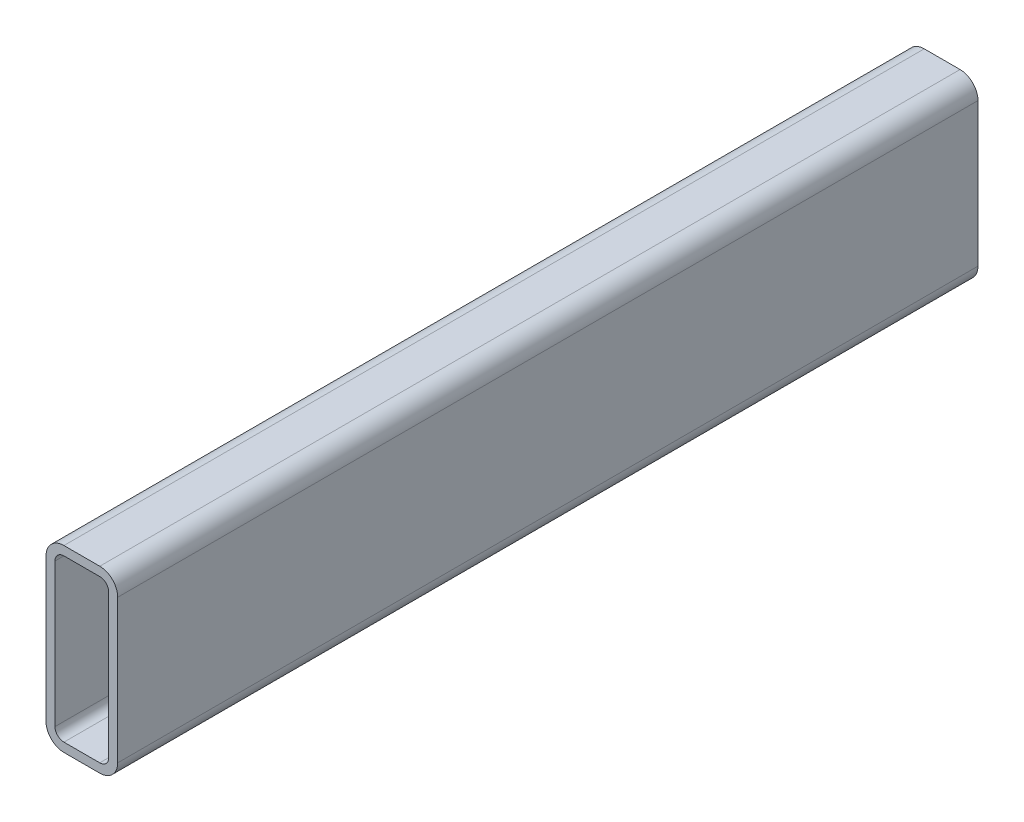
from build123d import *

# Parameters (mm, degrees)
BOSS_EXTRUDE1_DEPTH = 304.8


with BuildPart() as part:
    # Sketch1 → Boss-Extrude1 (new body)
    with BuildSketch(Plane.XY):
        with BuildLine():
            Line((25.4, 57.15), (25.4, 6.35))
            ThreePointArc((25.4, 6.35), (23.540128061, 1.859871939), (19.05, 0))
            Line((19.05, 0), (6.35, 0))
            ThreePointArc((6.35, 0), (1.859871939, 1.859871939), (0, 6.35))
            Line((0, 6.35), (0, 57.15))
            ThreePointArc((0, 57.15), (1.859871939, 61.640128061), (6.35, 63.5))
            Line((6.35, 63.5), (19.05, 63.5))
            ThreePointArc((19.05, 63.5), (23.540128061, 61.640128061), (25.4, 57.15))
        make_face()
        with BuildLine():
            Line((6.35, 60.325), (19.05, 60.325))
            ThreePointArc((19.05, 60.325), (21.29506403, 59.39506403), (22.225, 57.15))
            Line((22.225, 57.15), (22.225, 6.35))
            ThreePointArc((22.225, 6.35), (21.29506403, 4.10493597), (19.05, 3.175))
            Line((19.05, 3.175), (6.35, 3.175))
            ThreePointArc((6.35, 3.175), (4.10493597, 4.10493597), (3.175, 6.35))
            Line((3.175, 6.35), (3.175, 57.15))
            ThreePointArc((3.175, 57.15), (4.10493597, 59.39506403), (6.35, 60.325))
        make_face(mode=Mode.SUBTRACT)
    extrude(amount=BOSS_EXTRUDE1_DEPTH)


solid = part.part
